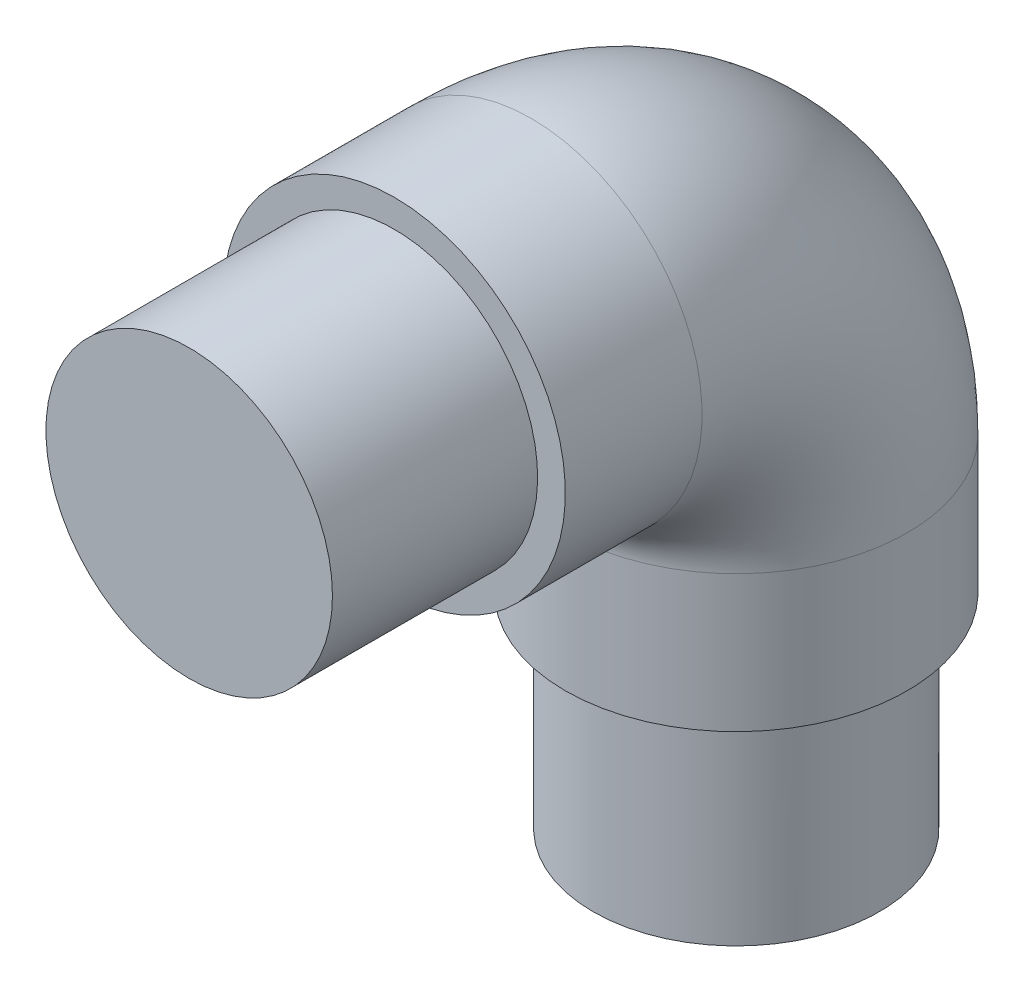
ISO-10303-21;
HEADER;
FILE_DESCRIPTION(('STEP AP214'),'2;1');
FILE_NAME('part.step','',(''),(''),'','','');
FILE_SCHEMA(('AUTOMOTIVE_DESIGN { 1 0 10303 214 1 1 1 1 }'));
ENDSEC;
DATA;
#1=APPLICATION_CONTEXT('core data for automotive mechanical design processes');
#2=APPLICATION_PROTOCOL_DEFINITION('international standard','automotive_design',2000,#1);
#3=PRODUCT_CONTEXT('',#1,'mechanical');
#4=PRODUCT('Part','Part','',(#3));
#5=PRODUCT_RELATED_PRODUCT_CATEGORY('part','',(#4));
#6=PRODUCT_DEFINITION_FORMATION('','',#4);
#7=PRODUCT_DEFINITION_CONTEXT('part definition',#1,'design');
#8=PRODUCT_DEFINITION('design','',#6,#7);
#9=PRODUCT_DEFINITION_SHAPE('','',#8);
#10=(LENGTH_UNIT() NAMED_UNIT(*) SI_UNIT(.MILLI.,.METRE.));
#11=(NAMED_UNIT(*) PLANE_ANGLE_UNIT() SI_UNIT($,.RADIAN.));
#12=(NAMED_UNIT(*) SI_UNIT($,.STERADIAN.) SOLID_ANGLE_UNIT());
#13=UNCERTAINTY_MEASURE_WITH_UNIT(LENGTH_MEASURE(1.E-05),#10,'distance_accuracy_value','');
#14=(GEOMETRIC_REPRESENTATION_CONTEXT(3) GLOBAL_UNCERTAINTY_ASSIGNED_CONTEXT((#13)) GLOBAL_UNIT_ASSIGNED_CONTEXT((#10,
#11,#12)) REPRESENTATION_CONTEXT('',''));
#15=CARTESIAN_POINT('',(0.,0.,0.));
#16=DIRECTION('',(0.,0.,1.));
#17=DIRECTION('',(1.,0.,0.));
#18=AXIS2_PLACEMENT_3D('',#15,#16,#17);
#19=CARTESIAN_POINT('',(0.,0.,15.));
#20=DIRECTION('',(0.,0.,-1.));
#21=DIRECTION('',(-1.,0.,0.));
#22=AXIS2_PLACEMENT_3D('',#19,#20,#21);
#23=CYLINDRICAL_SURFACE('',#22,10.475);
#24=CARTESIAN_POINT('',(0.,0.,15.));
#25=DIRECTION('',(0.,0.,1.));
#26=DIRECTION('',(1.,0.,0.));
#27=AXIS2_PLACEMENT_3D('',#24,#25,#26);
#28=CIRCLE('',#27,10.475);
#29=CARTESIAN_POINT('',(10.475,0.,15.));
#30=VERTEX_POINT('',#29);
#31=EDGE_CURVE('E54',#30,#30,#28,.T.);
#32=ORIENTED_EDGE('',*,*,#31,.F.);
#33=EDGE_LOOP('',(#32));
#34=FACE_BOUND('',#33,.T.);
#35=CARTESIAN_POINT('',(0.,0.,0.));
#36=DIRECTION('',(0.,0.,1.));
#37=DIRECTION('',(0.,-1.,0.));
#38=AXIS2_PLACEMENT_3D('',#35,#36,#37);
#39=CIRCLE('',#38,10.475);
#40=CARTESIAN_POINT('',(0.,-10.475,0.));
#41=VERTEX_POINT('',#40);
#42=EDGE_CURVE('E67',#41,#41,#39,.T.);
#43=ORIENTED_EDGE('',*,*,#42,.T.);
#44=EDGE_LOOP('',(#43));
#45=FACE_BOUND('',#44,.T.);
#46=ADVANCED_FACE('F47',(#34,#45),#23,.T.);
#47=CARTESIAN_POINT('',(0.,0.,15.));
#48=DIRECTION('',(0.,0.,1.));
#49=DIRECTION('',(1.,0.,0.));
#50=AXIS2_PLACEMENT_3D('',#47,#48,#49);
#51=PLANE('',#50);
#52=ORIENTED_EDGE('',*,*,#31,.T.);
#53=EDGE_LOOP('',(#52));
#54=FACE_BOUND('',#53,.T.);
#55=ADVANCED_FACE('F79',(#54),#51,.T.);
#56=CARTESIAN_POINT('',(0.,0.,0.));
#57=DIRECTION('',(0.,0.,1.));
#58=DIRECTION('',(0.,-1.,0.));
#59=AXIS2_PLACEMENT_3D('',#56,#57,#58);
#60=PLANE('',#59);
#61=ORIENTED_EDGE('',*,*,#42,.F.);
#62=EDGE_LOOP('',(#61));
#63=FACE_BOUND('',#62,.T.);
#64=CARTESIAN_POINT('',(0.,0.,0.));
#65=DIRECTION('',(0.,0.,1.));
#66=DIRECTION('',(0.,-1.,0.));
#67=AXIS2_PLACEMENT_3D('',#64,#65,#66);
#68=CIRCLE('',#67,12.5);
#69=CARTESIAN_POINT('',(0.,-12.5,0.));
#70=VERTEX_POINT('',#69);
#71=EDGE_CURVE('E59',#70,#70,#68,.T.);
#72=ORIENTED_EDGE('',*,*,#71,.T.);
#73=EDGE_LOOP('',(#72));
#74=FACE_BOUND('',#73,.T.);
#75=ADVANCED_FACE('F85',(#63,#74),#60,.T.);
#76=CARTESIAN_POINT('',(0.,-25.,-25.));
#77=DIRECTION('',(0.,1.,0.));
#78=DIRECTION('',(0.,0.,1.));
#79=AXIS2_PLACEMENT_3D('',#76,#77,#78);
#80=PLANE('',#79);
#81=CARTESIAN_POINT('',(0.,-25.,-25.));
#82=DIRECTION('',(0.,1.,0.));
#83=DIRECTION('',(0.,0.,1.));
#84=AXIS2_PLACEMENT_3D('',#81,#82,#83);
#85=CIRCLE('',#84,10.475);
#86=CARTESIAN_POINT('',(0.,-25.,-14.525));
#87=VERTEX_POINT('',#86);
#88=EDGE_CURVE('E12',#87,#87,#85,.F.);
#89=ORIENTED_EDGE('',*,*,#88,.F.);
#90=EDGE_LOOP('',(#89));
#91=FACE_BOUND('',#90,.T.);
#92=CARTESIAN_POINT('',(0.,-25.,-25.));
#93=DIRECTION('',(0.,1.,0.));
#94=DIRECTION('',(0.,0.,1.));
#95=AXIS2_PLACEMENT_3D('',#92,#93,#94);
#96=CIRCLE('',#95,12.5);
#97=CARTESIAN_POINT('',(0.,-25.,-12.5));
#98=VERTEX_POINT('',#97);
#99=EDGE_CURVE('E63',#98,#98,#96,.T.);
#100=ORIENTED_EDGE('',*,*,#99,.F.);
#101=EDGE_LOOP('',(#100));
#102=FACE_BOUND('',#101,.T.);
#103=ADVANCED_FACE('F88',(#91,#102),#80,.F.);
#104=CARTESIAN_POINT('',(0.,0.,0.));
#105=DIRECTION('',(0.,0.,-1.));
#106=DIRECTION('',(-1.,0.,0.));
#107=AXIS2_PLACEMENT_3D('',#104,#105,#106);
#108=CYLINDRICAL_SURFACE('',#107,12.5);
#109=CARTESIAN_POINT('',(0.,0.,-9.9999999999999));
#110=DIRECTION('',(0.,0.,1.));
#111=DIRECTION('',(0.,-1.,0.));
#112=AXIS2_PLACEMENT_3D('',#109,#110,#111);
#113=CIRCLE('',#112,12.5);
#114=CARTESIAN_POINT('',(0.,12.5,-9.99999999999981));
#115=VERTEX_POINT('',#114);
#116=EDGE_CURVE('E73',#115,#115,#113,.T.);
#117=ORIENTED_EDGE('',*,*,#116,.T.);
#118=EDGE_LOOP('',(#117));
#119=FACE_BOUND('',#118,.T.);
#120=ORIENTED_EDGE('',*,*,#71,.F.);
#121=EDGE_LOOP('',(#120));
#122=FACE_BOUND('',#121,.T.);
#123=ADVANCED_FACE('F106',(#119,#122),#108,.T.);
#124=CARTESIAN_POINT('',(0.,-15.,-10.));
#125=DIRECTION('',(-1.,0.,0.));
#126=DIRECTION('',(0.,0.,1.));
#127=AXIS2_PLACEMENT_3D('',#124,#125,#126);
#128=TOROIDAL_SURFACE('',#127,15.,12.5);
#129=CARTESIAN_POINT('',(0.,-14.9999999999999,-25.0000000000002));
#130=DIRECTION('',(0.,1.,0.));
#131=DIRECTION('',(0.,0.,1.));
#132=AXIS2_PLACEMENT_3D('',#129,#130,#131);
#133=CIRCLE('',#132,12.5);
#134=CARTESIAN_POINT('',(0.,-14.9999999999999,-37.5));
#135=VERTEX_POINT('',#134);
#136=EDGE_CURVE('E68',#135,#135,#133,.T.);
#137=CARTESIAN_POINT('',(0.,-15.,-10.));
#138=DIRECTION('',(-1.,0.,0.));
#139=DIRECTION('',(0.,0.,1.));
#140=AXIS2_PLACEMENT_3D('',#137,#138,#139);
#141=CIRCLE('',#140,27.5);
#142=EDGE_CURVE('',#115,#135,#141,.T.);
#143=ORIENTED_EDGE('',*,*,#116,.F.);
#144=ORIENTED_EDGE('',*,*,#136,.T.);
#145=ORIENTED_EDGE('',*,*,#142,.T.);
#146=ORIENTED_EDGE('',*,*,#142,.F.);
#147=EDGE_LOOP('',(#143,#145,#144,#146));
#148=FACE_BOUND('',#147,.T.);
#149=ADVANCED_FACE('F111',(#148),#128,.T.);
#150=CARTESIAN_POINT('',(0.,-15.0000000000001,-25.));
#151=DIRECTION('',(0.,-1.,0.));
#152=DIRECTION('',(0.,0.,-1.));
#153=AXIS2_PLACEMENT_3D('',#150,#151,#152);
#154=CYLINDRICAL_SURFACE('',#153,12.5);
#155=ORIENTED_EDGE('',*,*,#99,.T.);
#156=EDGE_LOOP('',(#155));
#157=FACE_BOUND('',#156,.T.);
#158=ORIENTED_EDGE('',*,*,#136,.F.);
#159=EDGE_LOOP('',(#158));
#160=FACE_BOUND('',#159,.T.);
#161=ADVANCED_FACE('F64',(#157,#160),#154,.T.);
#162=CARTESIAN_POINT('',(0.,-40.,-25.));
#163=DIRECTION('',(0.,1.,0.));
#164=DIRECTION('',(0.,0.,1.));
#165=AXIS2_PLACEMENT_3D('',#162,#163,#164);
#166=CYLINDRICAL_SURFACE('',#165,10.475);
#167=CARTESIAN_POINT('',(0.,-40.,-25.));
#168=DIRECTION('',(0.,-1.,0.));
#169=DIRECTION('',(0.,0.,-1.));
#170=AXIS2_PLACEMENT_3D('',#167,#168,#169);
#171=CIRCLE('',#170,10.475);
#172=CARTESIAN_POINT('',(0.,-40.,-35.475));
#173=VERTEX_POINT('',#172);
#174=EDGE_CURVE('E91',#173,#173,#171,.T.);
#175=ORIENTED_EDGE('',*,*,#174,.F.);
#176=EDGE_LOOP('',(#175));
#177=FACE_BOUND('',#176,.T.);
#178=ORIENTED_EDGE('',*,*,#88,.T.);
#179=EDGE_LOOP('',(#178));
#180=FACE_BOUND('',#179,.T.);
#181=ADVANCED_FACE('F90',(#177,#180),#166,.T.);
#182=CARTESIAN_POINT('',(0.,-40.,-25.));
#183=DIRECTION('',(0.,-1.,0.));
#184=DIRECTION('',(0.,0.,-1.));
#185=AXIS2_PLACEMENT_3D('',#182,#183,#184);
#186=PLANE('',#185);
#187=ORIENTED_EDGE('',*,*,#174,.T.);
#188=EDGE_LOOP('',(#187));
#189=FACE_BOUND('',#188,.T.);
#190=ADVANCED_FACE('F98',(#189),#186,.T.);
#191=CLOSED_SHELL('',(#46,#55,#75,#103,#123,#149,#161,#181,#190));
#192=MANIFOLD_SOLID_BREP('B2',#191);
#193=ADVANCED_BREP_SHAPE_REPRESENTATION('',(#18,#192),#14);
#194=SHAPE_DEFINITION_REPRESENTATION(#9,#193);
ENDSEC;
END-ISO-10303-21;
